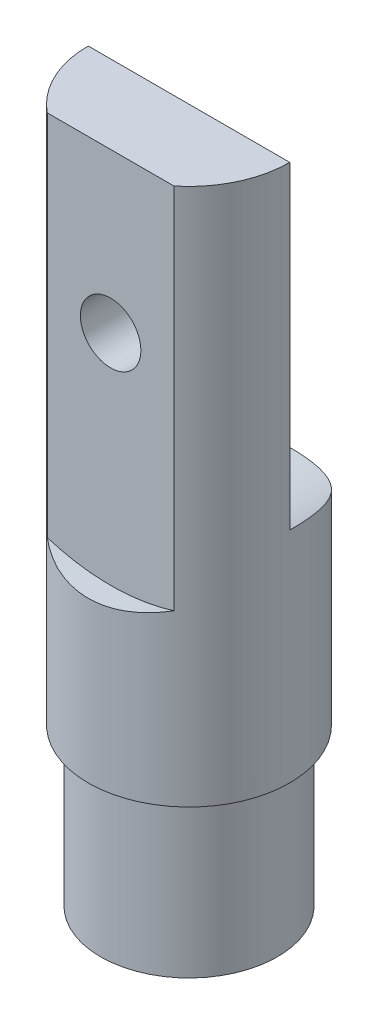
ISO-10303-21;
HEADER;
FILE_DESCRIPTION(('STEP AP214'),'2;1');
FILE_NAME('part.step','',(''),(''),'','','');
FILE_SCHEMA(('AUTOMOTIVE_DESIGN { 1 0 10303 214 1 1 1 1 }'));
ENDSEC;
DATA;
#1=APPLICATION_CONTEXT('core data for automotive mechanical design processes');
#2=APPLICATION_PROTOCOL_DEFINITION('international standard','automotive_design',2000,#1);
#3=PRODUCT_CONTEXT('',#1,'mechanical');
#4=PRODUCT('Part','Part','',(#3));
#5=PRODUCT_RELATED_PRODUCT_CATEGORY('part','',(#4));
#6=PRODUCT_DEFINITION_FORMATION('','',#4);
#7=PRODUCT_DEFINITION_CONTEXT('part definition',#1,'design');
#8=PRODUCT_DEFINITION('design','',#6,#7);
#9=PRODUCT_DEFINITION_SHAPE('','',#8);
#10=(LENGTH_UNIT() NAMED_UNIT(*) SI_UNIT(.MILLI.,.METRE.));
#11=(NAMED_UNIT(*) PLANE_ANGLE_UNIT() SI_UNIT($,.RADIAN.));
#12=(NAMED_UNIT(*) SI_UNIT($,.STERADIAN.) SOLID_ANGLE_UNIT());
#13=UNCERTAINTY_MEASURE_WITH_UNIT(LENGTH_MEASURE(1.E-05),#10,'distance_accuracy_value','');
#14=(GEOMETRIC_REPRESENTATION_CONTEXT(3) GLOBAL_UNCERTAINTY_ASSIGNED_CONTEXT((#13)) GLOBAL_UNIT_ASSIGNED_CONTEXT((#10,
#11,#12)) REPRESENTATION_CONTEXT('',''));
#15=CARTESIAN_POINT('',(0.,0.,0.));
#16=DIRECTION('',(0.,0.,1.));
#17=DIRECTION('',(1.,0.,0.));
#18=AXIS2_PLACEMENT_3D('',#15,#16,#17);
#19=CARTESIAN_POINT('',(0.,2.,0.));
#20=DIRECTION('',(0.,-1.,0.));
#21=DIRECTION('',(0.,0.,-1.));
#22=AXIS2_PLACEMENT_3D('',#19,#20,#21);
#23=CYLINDRICAL_SURFACE('',#22,2.5);
#24=DIRECTION('',(0.,-1.,0.));
#25=VECTOR('',#24,1.);
#26=CARTESIAN_POINT('',(1.5,2.,-2.));
#27=LINE('',#26,#25);
#28=CARTESIAN_POINT('',(1.5,-7.,-2.));
#29=VERTEX_POINT('',#28);
#30=CARTESIAN_POINT('',(1.5,2.,-2.));
#31=VERTEX_POINT('',#30);
#32=EDGE_CURVE('E60',#29,#31,#27,.F.);
#33=ORIENTED_EDGE('',*,*,#32,.F.);
#34=CARTESIAN_POINT('',(0.,-7.,0.));
#35=DIRECTION('',(0.,-1.,0.));
#36=DIRECTION('',(0.,0.,-1.));
#37=AXIS2_PLACEMENT_3D('',#34,#35,#36);
#38=CIRCLE('',#37,2.5);
#39=CARTESIAN_POINT('',(1.5,-7.,2.));
#40=VERTEX_POINT('',#39);
#41=EDGE_CURVE('E114',#29,#40,#38,.T.);
#42=ORIENTED_EDGE('',*,*,#41,.T.);
#43=DIRECTION('',(0.,-1.,0.));
#44=VECTOR('',#43,1.);
#45=CARTESIAN_POINT('',(1.5,2.,2.));
#46=LINE('',#45,#44);
#47=CARTESIAN_POINT('',(1.5,2.,2.));
#48=VERTEX_POINT('',#47);
#49=EDGE_CURVE('E99',#48,#40,#46,.T.);
#50=ORIENTED_EDGE('',*,*,#49,.F.);
#51=CARTESIAN_POINT('',(0.,2.,0.));
#52=DIRECTION('',(0.,-1.,0.));
#53=DIRECTION('',(0.,0.,-1.));
#54=AXIS2_PLACEMENT_3D('',#51,#52,#53);
#55=CIRCLE('',#54,2.5);
#56=EDGE_CURVE('E121',#31,#48,#55,.T.);
#57=ORIENTED_EDGE('',*,*,#56,.F.);
#58=EDGE_LOOP('',(#33,#42,#50,#57));
#59=FACE_BOUND('',#58,.T.);
#60=ADVANCED_FACE('F36',(#59),#23,.F.);
#61=DIRECTION('',(0.,-1.,0.));
#62=VECTOR('',#61,1.);
#63=CARTESIAN_POINT('',(-1.5,2.,-2.));
#64=LINE('',#63,#62);
#65=CARTESIAN_POINT('',(-1.5,2.,-2.));
#66=VERTEX_POINT('',#65);
#67=CARTESIAN_POINT('',(-1.5,-7.,-2.));
#68=VERTEX_POINT('',#67);
#69=EDGE_CURVE('E215',#66,#68,#64,.T.);
#70=ORIENTED_EDGE('',*,*,#69,.F.);
#71=CARTESIAN_POINT('',(-1.5,2.,2.));
#72=VERTEX_POINT('',#71);
#73=EDGE_CURVE('E118',#72,#66,#55,.T.);
#74=ORIENTED_EDGE('',*,*,#73,.F.);
#75=DIRECTION('',(0.,-1.,0.));
#76=VECTOR('',#75,1.);
#77=CARTESIAN_POINT('',(-1.5,2.,2.));
#78=LINE('',#77,#76);
#79=CARTESIAN_POINT('',(-1.5,-7.,2.));
#80=VERTEX_POINT('',#79);
#81=EDGE_CURVE('E52',#80,#72,#78,.F.);
#82=ORIENTED_EDGE('',*,*,#81,.F.);
#83=EDGE_CURVE('E116',#80,#68,#38,.T.);
#84=ORIENTED_EDGE('',*,*,#83,.T.);
#85=EDGE_LOOP('',(#70,#74,#82,#84));
#86=FACE_BOUND('',#85,.T.);
#87=ADVANCED_FACE('F177',(#86),#23,.F.);
#88=CARTESIAN_POINT('',(0.,2.,0.));
#89=DIRECTION('',(0.,-1.,0.));
#90=DIRECTION('',(0.,0.,-1.));
#91=AXIS2_PLACEMENT_3D('',#88,#89,#90);
#92=PLANE('',#91);
#93=ORIENTED_EDGE('',*,*,#73,.T.);
#94=DIRECTION('',(1.,0.,0.));
#95=VECTOR('',#94,1.);
#96=CARTESIAN_POINT('',(0.,2.,-2.));
#97=LINE('',#96,#95);
#98=EDGE_CURVE('E11',#66,#31,#97,.T.);
#99=ORIENTED_EDGE('',*,*,#98,.T.);
#100=ORIENTED_EDGE('',*,*,#56,.T.);
#101=DIRECTION('',(-1.,0.,0.));
#102=VECTOR('',#101,1.);
#103=CARTESIAN_POINT('',(0.,2.,2.));
#104=LINE('',#103,#102);
#105=EDGE_CURVE('E45',#48,#72,#104,.T.);
#106=ORIENTED_EDGE('',*,*,#105,.T.);
#107=EDGE_LOOP('',(#93,#99,#100,#106));
#108=FACE_BOUND('',#107,.T.);
#109=ADVANCED_FACE('F174',(#108),#92,.T.);
#110=CARTESIAN_POINT('',(0.,24.,0.));
#111=DIRECTION('',(0.,-1.,0.));
#112=DIRECTION('',(0.,0.,-1.));
#113=AXIS2_PLACEMENT_3D('',#110,#111,#112);
#114=CYLINDRICAL_SURFACE('',#113,4.5);
#115=CARTESIAN_POINT('',(0.,0.,0.));
#116=DIRECTION('',(0.,1.,0.));
#117=DIRECTION('',(0.,0.,1.));
#118=AXIS2_PLACEMENT_3D('',#115,#116,#117);
#119=CIRCLE('',#118,4.5);
#120=CARTESIAN_POINT('',(0.,0.,4.5));
#121=VERTEX_POINT('',#120);
#122=EDGE_CURVE('E134',#121,#121,#119,.T.);
#123=ORIENTED_EDGE('',*,*,#122,.T.);
#124=EDGE_LOOP('',(#123));
#125=FACE_BOUND('',#124,.T.);
#126=CARTESIAN_POINT('',(-2.82842712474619,7.57328551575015,3.5));
#127=CARTESIAN_POINT('',(-2.73477703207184,7.5439040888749,3.57568711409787));
#128=CARTESIAN_POINT('',(-2.63795159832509,7.5151475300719,3.64771357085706));
#129=CARTESIAN_POINT('',(-2.4384147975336,7.4595224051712,3.78400925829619));
#130=CARTESIAN_POINT('',(-2.33570099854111,7.43265462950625,3.84827524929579));
#131=CARTESIAN_POINT('',(-2.12462415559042,7.3813963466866,3.96872543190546));
#132=CARTESIAN_POINT('',(-2.01624553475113,7.35701327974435,4.02488554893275));
#133=CARTESIAN_POINT('',(-1.79473997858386,7.31141985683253,4.12841988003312));
#134=CARTESIAN_POINT('',(-1.68161368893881,7.29020907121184,4.17579528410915));
#135=CARTESIAN_POINT('',(-1.45093592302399,7.25144073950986,4.26145148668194));
#136=CARTESIAN_POINT('',(-1.33337156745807,7.23389497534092,4.29970300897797));
#137=CARTESIAN_POINT('',(-1.09497804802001,7.20301402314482,4.36650251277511));
#138=CARTESIAN_POINT('',(-0.974149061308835,7.18967860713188,4.39505101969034));
#139=CARTESIAN_POINT('',(-0.730356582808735,7.16760826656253,4.44206732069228));
#140=CARTESIAN_POINT('',(-0.607397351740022,7.15886505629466,4.46055327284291));
#141=CARTESIAN_POINT('',(-0.360128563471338,7.14619250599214,4.48728968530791));
#142=CARTESIAN_POINT('',(-0.235819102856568,7.14226282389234,4.49554087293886));
#143=CARTESIAN_POINT('',(0.00556519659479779,7.13941822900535,4.50151641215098));
#144=CARTESIAN_POINT('',(0.122622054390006,7.140213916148,4.49984825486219));
#145=CARTESIAN_POINT('',(0.356179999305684,7.14613117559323,4.4874065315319));
#146=CARTESIAN_POINT('',(0.472680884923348,7.15125421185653,4.47662988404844));
#147=CARTESIAN_POINT('',(0.704281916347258,7.16570288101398,4.44608038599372));
#148=CARTESIAN_POINT('',(0.819381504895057,7.1750301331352,4.42630406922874));
#149=CARTESIAN_POINT('',(1.04734080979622,7.19764926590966,4.37797601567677));
#150=CARTESIAN_POINT('',(1.16019971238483,7.21094255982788,4.34942115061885));
#151=CARTESIAN_POINT('',(1.49125217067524,7.25590423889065,4.2518845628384));
#152=CARTESIAN_POINT('',(1.70522473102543,7.29287529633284,4.17058333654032));
#153=CARTESIAN_POINT('',(2.11636835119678,7.37774444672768,3.97775552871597));
#154=CARTESIAN_POINT('',(2.31355702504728,7.42563088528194,3.86626116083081));
#155=CARTESIAN_POINT('',(2.55711467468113,7.49244360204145,3.70348649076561));
#156=CARTESIAN_POINT('',(2.61278258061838,7.50828341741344,3.66442218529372));
#157=CARTESIAN_POINT('',(2.72210007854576,7.54044509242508,3.5839588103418));
#158=CARTESIAN_POINT('',(2.77575308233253,7.55676604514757,3.54256401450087));
#159=CARTESIAN_POINT('',(2.82842712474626,7.57328551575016,3.5000000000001));
#160=B_SPLINE_CURVE_WITH_KNOTS('',3,(#126,#127,#128,#129,#130,#131,#132,#133,#134,#135,#136,
#137,#138,#139,#140,#141,#142,#143,#144,#145,#146,#147,#148,#149,#150,#151,#152,#153,#154,#155,
#156,#157,#158,#159),.UNSPECIFIED.,.F.,.F.,(4,2,2,2,2,2,2,2,2,2,2,2,2,2,2,2,4),(0.,
0.371760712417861,0.743676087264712,1.11667427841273,1.4896219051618,1.86375059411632,
2.23785902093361,2.61129010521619,2.98469465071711,3.33547612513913,3.68637631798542,
4.03741177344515,4.38857246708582,5.08099666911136,5.77268500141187,5.98211961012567,
6.19118193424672),.UNSPECIFIED.);
#161=CARTESIAN_POINT('',(-2.82842712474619,7.57328551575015,3.5));
#162=VERTEX_POINT('',#161);
#163=CARTESIAN_POINT('',(2.82842712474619,7.57328551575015,3.5));
#164=VERTEX_POINT('',#163);
#165=EDGE_CURVE('E147',#162,#164,#160,.T.);
#166=ORIENTED_EDGE('',*,*,#165,.F.);
#167=DIRECTION('',(0.,1.,0.));
#168=VECTOR('',#167,1.);
#169=CARTESIAN_POINT('',(-2.82842712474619,16.,3.5));
#170=LINE('',#169,#168);
#171=CARTESIAN_POINT('',(-2.82842712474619,24.,3.5));
#172=VERTEX_POINT('',#171);
#173=EDGE_CURVE('E205',#162,#172,#170,.T.);
#174=ORIENTED_EDGE('',*,*,#173,.T.);
#175=CARTESIAN_POINT('',(0.,24.,0.));
#176=DIRECTION('',(0.,1.,0.));
#177=DIRECTION('',(0.,0.,1.));
#178=AXIS2_PLACEMENT_3D('',#175,#176,#177);
#179=CIRCLE('',#178,4.5);
#180=CARTESIAN_POINT('',(-4.5,24.,0.));
#181=VERTEX_POINT('',#180);
#182=EDGE_CURVE('E137',#181,#172,#179,.T.);
#183=ORIENTED_EDGE('',*,*,#182,.F.);
#184=DIRECTION('',(0.,1.,0.));
#185=VECTOR('',#184,1.);
#186=CARTESIAN_POINT('',(-4.5,16.,0.));
#187=LINE('',#186,#185);
#188=CARTESIAN_POINT('',(-4.5,9.77777802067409,0.));
#189=VERTEX_POINT('',#188);
#190=EDGE_CURVE('E234',#189,#181,#187,.T.);
#191=ORIENTED_EDGE('',*,*,#190,.F.);
#192=CARTESIAN_POINT('',(4.5,9.77777802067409,0.));
#193=CARTESIAN_POINT('',(4.50002255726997,9.77781675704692,-0.116569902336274));
#194=CARTESIAN_POINT('',(4.49547132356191,9.77491778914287,-0.233117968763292));
#195=CARTESIAN_POINT('',(4.47739928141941,9.76353705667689,-0.465160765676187));
#196=CARTESIAN_POINT('',(4.46388492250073,9.75505930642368,-0.580656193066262));
#197=CARTESIAN_POINT('',(4.42817962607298,9.73288454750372,-0.809015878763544));
#198=CARTESIAN_POINT('',(4.40604518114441,9.71922153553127,-0.921892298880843));
#199=CARTESIAN_POINT('',(4.35340961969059,9.68719632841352,-1.14497770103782));
#200=CARTESIAN_POINT('',(4.32290733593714,9.66883347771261,-1.2551863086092));
#201=CARTESIAN_POINT('',(4.21953910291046,9.60771372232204,-1.58018646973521));
#202=CARTESIAN_POINT('',(4.13468464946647,9.55884143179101,-1.79014607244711));
#203=CARTESIAN_POINT('',(3.93590831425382,9.45040770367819,-2.19300968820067));
#204=CARTESIAN_POINT('',(3.82193469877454,9.39082729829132,-2.38588251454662));
#205=CARTESIAN_POINT('',(3.55566904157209,9.26091551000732,-2.76886299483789));
#206=CARTESIAN_POINT('',(3.40077988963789,9.19010004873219,-2.95700129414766));
#207=CARTESIAN_POINT('',(3.06235103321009,9.04956804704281,-3.30621981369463));
#208=CARTESIAN_POINT('',(2.87880276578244,8.97985184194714,-3.46729191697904));
#209=CARTESIAN_POINT('',(2.57671661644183,8.8783833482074,-3.69160946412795));
#210=CARTESIAN_POINT('',(2.46705949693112,8.84390618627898,-3.76579812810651));
#211=CARTESIAN_POINT('',(2.24094884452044,8.77812107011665,-3.90457718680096));
#212=CARTESIAN_POINT('',(2.12449807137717,8.7468118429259,-3.96917144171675));
#213=CARTESIAN_POINT('',(1.88553425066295,8.68826770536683,-4.08810109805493));
#214=CARTESIAN_POINT('',(1.76302302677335,8.66103157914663,-4.14243956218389));
#215=CARTESIAN_POINT('',(1.51277519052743,8.61144246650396,-4.24022982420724));
#216=CARTESIAN_POINT('',(1.3850392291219,8.58908887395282,-4.28368297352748));
#217=CARTESIAN_POINT('',(1.13568378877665,8.55152307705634,-4.35611273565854));
#218=CARTESIAN_POINT('',(1.01438215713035,8.53588522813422,-4.38596387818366));
#219=CARTESIAN_POINT('',(0.769183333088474,8.50978846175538,-4.43553792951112));
#220=CARTESIAN_POINT('',(0.64528643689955,8.49932895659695,-4.4552619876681));
#221=CARTESIAN_POINT('',(0.396006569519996,8.48389739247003,-4.48429666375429));
#222=CARTESIAN_POINT('',(0.270624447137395,8.47892233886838,-4.49361296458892));
#223=CARTESIAN_POINT('',(0.0194272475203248,8.47459873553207,-4.50171193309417));
#224=CARTESIAN_POINT('',(-0.106387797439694,8.47524977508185,-4.500495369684));
#225=CARTESIAN_POINT('',(-0.344858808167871,8.48181300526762,-4.48819368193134));
#226=CARTESIAN_POINT('',(-0.457582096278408,8.48719690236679,-4.47809945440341));
#227=CARTESIAN_POINT('',(-0.681690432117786,8.50238178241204,-4.44950146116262));
#228=CARTESIAN_POINT('',(-0.793075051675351,8.51218414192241,-4.43099507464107));
#229=CARTESIAN_POINT('',(-1.01367311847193,8.53597319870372,-4.38578784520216));
#230=CARTESIAN_POINT('',(-1.12288732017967,8.54995841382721,-4.35908990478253));
#231=CARTESIAN_POINT('',(-1.33851175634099,8.58179013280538,-4.29778681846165));
#232=CARTESIAN_POINT('',(-1.4449208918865,8.59963812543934,-4.26317862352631));
#233=CARTESIAN_POINT('',(-1.76139598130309,8.65886504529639,-4.14707915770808));
#234=CARTESIAN_POINT('',(-1.96627664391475,8.7056529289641,-4.05381688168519));
#235=CARTESIAN_POINT('',(-2.35780305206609,8.80957459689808,-3.83936592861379));
#236=CARTESIAN_POINT('',(-2.54444251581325,8.86671192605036,-3.71816767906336));
#237=CARTESIAN_POINT('',(-2.91502102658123,8.99314237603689,-3.43688462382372));
#238=CARTESIAN_POINT('',(-3.09667468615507,9.06308160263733,-3.27407117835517));
#239=CARTESIAN_POINT('',(-3.43142748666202,9.20372678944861,-2.92140155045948));
#240=CARTESIAN_POINT('',(-3.58449446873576,9.27443351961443,-2.73151533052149));
#241=CARTESIAN_POINT('',(-3.86998198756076,9.41498329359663,-2.31141427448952));
#242=CARTESIAN_POINT('',(-3.99975357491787,9.48429996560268,-2.07918457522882));
#243=CARTESIAN_POINT('',(-4.16286647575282,9.57539478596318,-1.71414978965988));
#244=CARTESIAN_POINT('',(-4.21195715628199,9.6035980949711,-1.58978079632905));
#245=CARTESIAN_POINT('',(-4.29913008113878,9.65460950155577,-1.33620519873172));
#246=CARTESIAN_POINT('',(-4.33721696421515,9.67741987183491,-1.20700065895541));
#247=CARTESIAN_POINT('',(-4.41242278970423,9.72302437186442,-0.901492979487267));
#248=CARTESIAN_POINT('',(-4.44510305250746,9.7433454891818,-0.723676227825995));
#249=CARTESIAN_POINT('',(-4.47795377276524,9.76388901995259,-0.454084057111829));
#250=CARTESIAN_POINT('',(-4.48620926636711,9.76908083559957,-0.363580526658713));
#251=CARTESIAN_POINT('',(-4.49723509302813,9.77603066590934,-0.182063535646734));
#252=CARTESIAN_POINT('',(-4.50000265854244,9.77778694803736,-0.0910498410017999));
#253=CARTESIAN_POINT('',(-4.5,9.77777802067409,0.));
#254=B_SPLINE_CURVE_WITH_KNOTS('',3,(#192,#193,#194,#195,#196,#197,#198,#199,#200,#201,#202,
#203,#204,#205,#206,#207,#208,#209,#210,#211,#212,#213,#214,#215,#216,#217,#218,#219,#220,#221,
#222,#223,#224,#225,#226,#227,#228,#229,#230,#231,#232,#233,#234,#235,#236,#237,#238,#239,#240,
#241,#242,#243,#244,#245,#246,#247,#248,#249,#250,#251,#252,#253),.UNSPECIFIED.,.F.,.F.,(4,2,2,
2,2,2,2,2,2,2,2,2,2,2,2,2,2,2,2,2,2,2,2,2,2,2,2,2,2,2,4),(0.,0.349549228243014,
0.698847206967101,1.04589353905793,1.39298830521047,2.08478379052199,2.77781698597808,
3.5360876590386,4.29458532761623,4.70456350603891,5.11437628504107,5.52406648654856,
5.93370579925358,6.31087178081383,6.68799494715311,7.06491209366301,7.44180172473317,
7.78130525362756,8.12091462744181,8.46040380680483,8.80002406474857,9.48667631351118,
10.1735642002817,10.9316540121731,11.6905915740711,12.5105397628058,12.9199528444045,
13.3291930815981,13.8730366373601,14.1459195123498,14.4189399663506),.UNSPECIFIED.);
#255=CARTESIAN_POINT('',(4.5,9.77777802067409,0.));
#256=VERTEX_POINT('',#255);
#257=EDGE_CURVE('E129',#256,#189,#254,.T.);
#258=ORIENTED_EDGE('',*,*,#257,.F.);
#259=DIRECTION('',(0.,1.,0.));
#260=VECTOR('',#259,1.);
#261=CARTESIAN_POINT('',(4.5,16.,0.));
#262=LINE('',#261,#260);
#263=CARTESIAN_POINT('',(4.5,24.,0.));
#264=VERTEX_POINT('',#263);
#265=EDGE_CURVE('E123',#256,#264,#262,.T.);
#266=ORIENTED_EDGE('',*,*,#265,.T.);
#267=CARTESIAN_POINT('',(2.82842712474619,24.,3.5));
#268=VERTEX_POINT('',#267);
#269=EDGE_CURVE('E130',#268,#264,#179,.T.);
#270=ORIENTED_EDGE('',*,*,#269,.F.);
#271=DIRECTION('',(0.,1.,0.));
#272=VECTOR('',#271,1.);
#273=CARTESIAN_POINT('',(2.82842712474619,16.,3.5));
#274=LINE('',#273,#272);
#275=EDGE_CURVE('E208',#164,#268,#274,.T.);
#276=ORIENTED_EDGE('',*,*,#275,.F.);
#277=EDGE_LOOP('',(#166,#174,#183,#191,#258,#266,#270,#276));
#278=FACE_BOUND('',#277,.T.);
#279=ADVANCED_FACE('F38',(#125,#278),#114,.T.);
#280=CARTESIAN_POINT('',(0.,16.9015566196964,4.5));
#281=DIRECTION('',(0.,0.,-1.));
#282=DIRECTION('',(-1.,0.,0.));
#283=AXIS2_PLACEMENT_3D('',#280,#281,#282);
#284=CYLINDRICAL_SURFACE('',#283,1.35);
#285=CARTESIAN_POINT('',(0.,16.9015566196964,0.));
#286=DIRECTION('',(0.,0.,-1.));
#287=DIRECTION('',(-1.,0.,0.));
#288=AXIS2_PLACEMENT_3D('',#285,#286,#287);
#289=CIRCLE('',#288,1.35);
#290=CARTESIAN_POINT('',(-1.35,16.9015566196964,0.));
#291=VERTEX_POINT('',#290);
#292=EDGE_CURVE('E225',#291,#291,#289,.T.);
#293=ORIENTED_EDGE('',*,*,#292,.T.);
#294=EDGE_LOOP('',(#293));
#295=FACE_BOUND('',#294,.T.);
#296=CARTESIAN_POINT('',(0.,16.9015566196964,3.5));
#297=DIRECTION('',(0.,0.,-1.));
#298=DIRECTION('',(-1.,0.,0.));
#299=AXIS2_PLACEMENT_3D('',#296,#297,#298);
#300=CIRCLE('',#299,1.35);
#301=CARTESIAN_POINT('',(-1.35,16.9015566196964,3.5));
#302=VERTEX_POINT('',#301);
#303=EDGE_CURVE('E228',#302,#302,#300,.T.);
#304=ORIENTED_EDGE('',*,*,#303,.F.);
#305=EDGE_LOOP('',(#304));
#306=FACE_BOUND('',#305,.T.);
#307=ADVANCED_FACE('F162',(#295,#306),#284,.F.);
#308=CARTESIAN_POINT('',(0.,24.,0.));
#309=DIRECTION('',(0.,1.,0.));
#310=DIRECTION('',(0.,0.,1.));
#311=AXIS2_PLACEMENT_3D('',#308,#309,#310);
#312=PLANE('',#311);
#313=DIRECTION('',(1.,0.,0.));
#314=VECTOR('',#313,1.);
#315=CARTESIAN_POINT('',(-4.5,24.,0.));
#316=LINE('',#315,#314);
#317=EDGE_CURVE('E232',#181,#264,#316,.T.);
#318=ORIENTED_EDGE('',*,*,#317,.F.);
#319=ORIENTED_EDGE('',*,*,#182,.T.);
#320=DIRECTION('',(-1.,0.,0.));
#321=VECTOR('',#320,1.);
#322=CARTESIAN_POINT('',(-2.82842712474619,24.,3.5));
#323=LINE('',#322,#321);
#324=EDGE_CURVE('E231',#268,#172,#323,.T.);
#325=ORIENTED_EDGE('',*,*,#324,.F.);
#326=ORIENTED_EDGE('',*,*,#269,.T.);
#327=EDGE_LOOP('',(#318,#319,#325,#326));
#328=FACE_BOUND('',#327,.T.);
#329=ADVANCED_FACE('F165',(#328),#312,.T.);
#330=CARTESIAN_POINT('',(0.,0.,0.));
#331=DIRECTION('',(0.,1.,0.));
#332=DIRECTION('',(0.,0.,1.));
#333=AXIS2_PLACEMENT_3D('',#330,#331,#332);
#334=PLANE('',#333);
#335=CARTESIAN_POINT('',(0.,0.,0.));
#336=DIRECTION('',(0.,-1.,0.));
#337=DIRECTION('',(0.,0.,-1.));
#338=AXIS2_PLACEMENT_3D('',#335,#336,#337);
#339=CIRCLE('',#338,3.95);
#340=CARTESIAN_POINT('',(0.,0.,-3.95));
#341=VERTEX_POINT('',#340);
#342=EDGE_CURVE('E126',#341,#341,#339,.T.);
#343=ORIENTED_EDGE('',*,*,#342,.F.);
#344=EDGE_LOOP('',(#343));
#345=FACE_BOUND('',#344,.T.);
#346=ORIENTED_EDGE('',*,*,#122,.F.);
#347=EDGE_LOOP('',(#346));
#348=FACE_BOUND('',#347,.T.);
#349=ADVANCED_FACE('F187',(#345,#348),#334,.F.);
#350=CARTESIAN_POINT('',(0.,0.,0.));
#351=DIRECTION('',(0.,-1.,0.));
#352=DIRECTION('',(0.,0.,-1.));
#353=AXIS2_PLACEMENT_3D('',#350,#351,#352);
#354=CYLINDRICAL_SURFACE('',#353,3.95);
#355=ORIENTED_EDGE('',*,*,#342,.T.);
#356=EDGE_LOOP('',(#355));
#357=FACE_BOUND('',#356,.T.);
#358=CARTESIAN_POINT('',(0.,-7.,0.));
#359=DIRECTION('',(0.,-1.,0.));
#360=DIRECTION('',(0.,0.,-1.));
#361=AXIS2_PLACEMENT_3D('',#358,#359,#360);
#362=CIRCLE('',#361,3.95);
#363=CARTESIAN_POINT('',(0.,-7.,-3.95));
#364=VERTEX_POINT('',#363);
#365=EDGE_CURVE('E131',#364,#364,#362,.T.);
#366=ORIENTED_EDGE('',*,*,#365,.F.);
#367=EDGE_LOOP('',(#366));
#368=FACE_BOUND('',#367,.T.);
#369=ADVANCED_FACE('F183',(#357,#368),#354,.T.);
#370=CARTESIAN_POINT('',(0.,-7.,0.));
#371=DIRECTION('',(0.,-1.,0.));
#372=DIRECTION('',(0.,0.,-1.));
#373=AXIS2_PLACEMENT_3D('',#370,#371,#372);
#374=PLANE('',#373);
#375=ORIENTED_EDGE('',*,*,#365,.T.);
#376=EDGE_LOOP('',(#375));
#377=FACE_BOUND('',#376,.T.);
#378=DIRECTION('',(1.,0.,0.));
#379=VECTOR('',#378,1.);
#380=CARTESIAN_POINT('',(-2.52984425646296,-7.,-2.));
#381=LINE('',#380,#379);
#382=EDGE_CURVE('E107',#68,#29,#381,.T.);
#383=ORIENTED_EDGE('',*,*,#382,.F.);
#384=ORIENTED_EDGE('',*,*,#83,.F.);
#385=DIRECTION('',(-1.,0.,0.));
#386=VECTOR('',#385,1.);
#387=CARTESIAN_POINT('',(-2.52984425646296,-7.,2.));
#388=LINE('',#387,#386);
#389=EDGE_CURVE('E102',#40,#80,#388,.T.);
#390=ORIENTED_EDGE('',*,*,#389,.F.);
#391=ORIENTED_EDGE('',*,*,#41,.F.);
#392=EDGE_LOOP('',(#383,#384,#390,#391));
#393=FACE_BOUND('',#392,.T.);
#394=ADVANCED_FACE('F113',(#377,#393),#374,.T.);
#395=CARTESIAN_POINT('',(-2.82842712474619,16.,3.5));
#396=DIRECTION('',(0.,0.,-1.));
#397=DIRECTION('',(-1.,0.,0.));
#398=AXIS2_PLACEMENT_3D('',#395,#396,#397);
#399=PLANE('',#398);
#400=ORIENTED_EDGE('',*,*,#303,.T.);
#401=EDGE_LOOP('',(#400));
#402=FACE_BOUND('',#401,.T.);
#403=ORIENTED_EDGE('',*,*,#173,.F.);
#404=CARTESIAN_POINT('',(0.,16.5914859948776,3.5));
#405=DIRECTION('',(0.,0.,1.));
#406=DIRECTION('',(1.,0.,0.));
#407=AXIS2_PLACEMENT_3D('',#404,#405,#406);
#408=CIRCLE('',#407,9.45134592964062);
#409=EDGE_CURVE('E217',#162,#164,#408,.T.);
#410=ORIENTED_EDGE('',*,*,#409,.T.);
#411=ORIENTED_EDGE('',*,*,#275,.T.);
#412=ORIENTED_EDGE('',*,*,#324,.T.);
#413=EDGE_LOOP('',(#403,#410,#411,#412));
#414=FACE_BOUND('',#413,.T.);
#415=ADVANCED_FACE('F169',(#402,#414),#399,.F.);
#416=CARTESIAN_POINT('',(-4.5,16.,0.));
#417=DIRECTION('',(0.,0.,1.));
#418=DIRECTION('',(1.,0.,0.));
#419=AXIS2_PLACEMENT_3D('',#416,#417,#418);
#420=PLANE('',#419);
#421=ORIENTED_EDGE('',*,*,#265,.F.);
#422=CARTESIAN_POINT('',(0.,16.9015566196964,0.));
#423=DIRECTION('',(0.,0.,-1.));
#424=DIRECTION('',(-1.,0.,0.));
#425=AXIS2_PLACEMENT_3D('',#422,#423,#424);
#426=CIRCLE('',#425,8.42604423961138);
#427=EDGE_CURVE('E222',#256,#189,#426,.T.);
#428=ORIENTED_EDGE('',*,*,#427,.T.);
#429=ORIENTED_EDGE('',*,*,#190,.T.);
#430=ORIENTED_EDGE('',*,*,#317,.T.);
#431=EDGE_LOOP('',(#421,#428,#429,#430));
#432=FACE_BOUND('',#431,.T.);
#433=ORIENTED_EDGE('',*,*,#292,.F.);
#434=EDGE_LOOP('',(#433));
#435=FACE_BOUND('',#434,.T.);
#436=ADVANCED_FACE('F158',(#432,#435),#420,.F.);
#437=CARTESIAN_POINT('',(0.,16.9015566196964,-8.));
#438=DIRECTION('',(0.,0.,1.));
#439=DIRECTION('',(1.,0.,0.));
#440=AXIS2_PLACEMENT_3D('',#437,#438,#439);
#441=CYLINDRICAL_SURFACE('',#440,8.42604423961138);
#442=ORIENTED_EDGE('',*,*,#257,.T.);
#443=ORIENTED_EDGE('',*,*,#427,.F.);
#444=EDGE_LOOP('',(#442,#443));
#445=FACE_BOUND('',#444,.T.);
#446=ADVANCED_FACE('F153',(#445),#441,.F.);
#447=CARTESIAN_POINT('',(0.,16.5914859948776,11.5));
#448=DIRECTION('',(0.,0.,-1.));
#449=DIRECTION('',(-1.,0.,0.));
#450=AXIS2_PLACEMENT_3D('',#447,#448,#449);
#451=CYLINDRICAL_SURFACE('',#450,9.45134592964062);
#452=ORIENTED_EDGE('',*,*,#165,.T.);
#453=ORIENTED_EDGE('',*,*,#409,.F.);
#454=EDGE_LOOP('',(#452,#453));
#455=FACE_BOUND('',#454,.T.);
#456=ADVANCED_FACE('F157',(#455),#451,.F.);
#457=CARTESIAN_POINT('',(-2.52984425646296,3.99999999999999,2.));
#458=DIRECTION('',(0.,0.,1.));
#459=DIRECTION('',(1.,0.,0.));
#460=AXIS2_PLACEMENT_3D('',#457,#458,#459);
#461=PLANE('',#460);
#462=ORIENTED_EDGE('',*,*,#389,.T.);
#463=ORIENTED_EDGE('',*,*,#81,.T.);
#464=ORIENTED_EDGE('',*,*,#105,.F.);
#465=ORIENTED_EDGE('',*,*,#49,.T.);
#466=EDGE_LOOP('',(#462,#463,#464,#465));
#467=FACE_BOUND('',#466,.T.);
#468=ADVANCED_FACE('F101',(#467),#461,.F.);
#469=CARTESIAN_POINT('',(-2.52984425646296,3.99999999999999,-2.));
#470=DIRECTION('',(0.,0.,-1.));
#471=DIRECTION('',(-1.,0.,0.));
#472=AXIS2_PLACEMENT_3D('',#469,#470,#471);
#473=PLANE('',#472);
#474=ORIENTED_EDGE('',*,*,#382,.T.);
#475=ORIENTED_EDGE('',*,*,#32,.T.);
#476=ORIENTED_EDGE('',*,*,#98,.F.);
#477=ORIENTED_EDGE('',*,*,#69,.T.);
#478=EDGE_LOOP('',(#474,#475,#476,#477));
#479=FACE_BOUND('',#478,.T.);
#480=ADVANCED_FACE('F252',(#479),#473,.F.);
#481=CLOSED_SHELL('',(#60,#87,#109,#279,#307,#329,#349,#369,#394,#415,#436,#446,#456,#468,#480));
#482=MANIFOLD_SOLID_BREP('B2',#481);
#483=ADVANCED_BREP_SHAPE_REPRESENTATION('',(#18,#482),#14);
#484=SHAPE_DEFINITION_REPRESENTATION(#9,#483);
ENDSEC;
END-ISO-10303-21;
